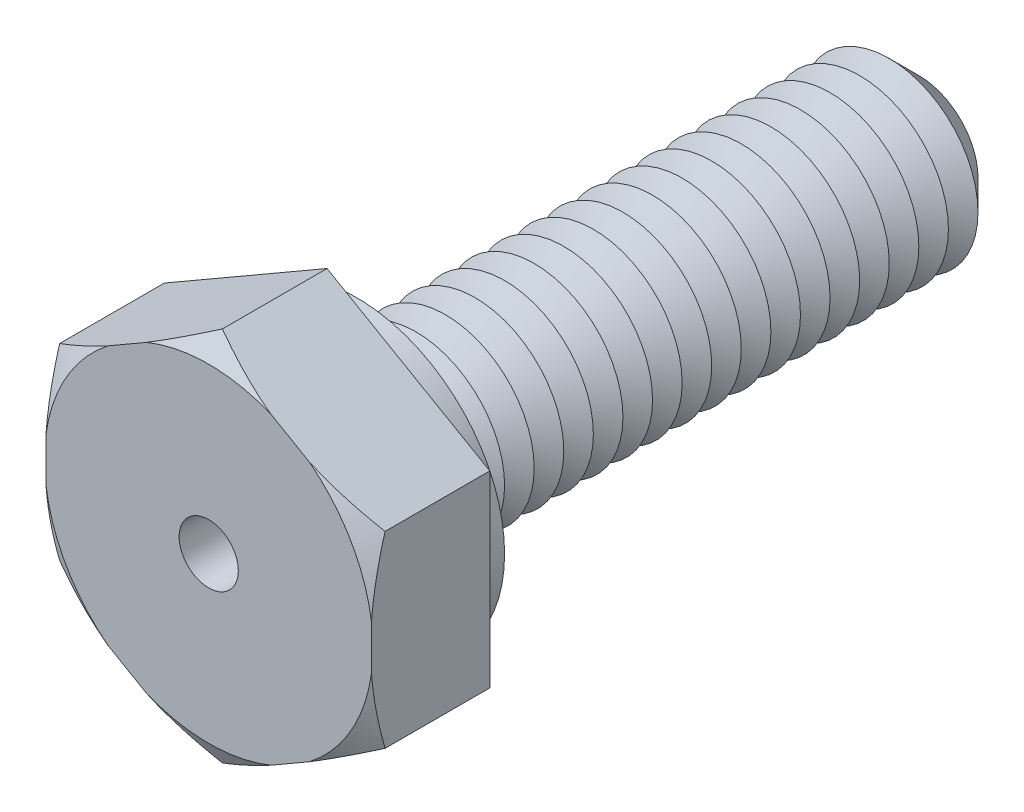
from build123d import *

# Parameters (mm, degrees)
BOSS_EXTRUDE1_DEPTH = 2
SKETCH3_R           = 1.5
BOSS_EXTRUDE2_DEPTH = 10
SKETCH4_R           = 2.5
BOSS_EXTRUDE3_DEPTH = 0.5
CHAMFER1_SIZE       = 0.5
LPATTERN1_COUNT     = 18
LPATTERN1_PITCH     = 0.5
SKETCH8_R           = 0.5
CUT_EXTRUDE1_DEPTH  = 12


with BuildPart() as part:
    # Sketch2 → Boss-Extrude1 (new body)
    with BuildSketch(Plane.XY):
        Polygon((0, 3.175426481), (-2.75, 1.58771324), (-2.75, -1.58771324), (0, -3.175426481), (2.75, -1.58771324), (2.75, 1.58771324), align=None)
    extrude(amount=BOSS_EXTRUDE1_DEPTH)

    # Sketch3 → Boss-Extrude2 (add)
    with BuildSketch(Plane(origin=(0, 0, 0), x_dir=(-1, 0, 0), z_dir=(0, 0, -1))):
        Circle(SKETCH3_R)
    extrude(amount=BOSS_EXTRUDE2_DEPTH)

    # Sketch4 → Boss-Extrude3 (add)
    with BuildSketch(Plane(origin=(0, 0, 0), x_dir=(-1, 0, 0), z_dir=(0, 0, -1))):
        with Locations(Location((0, 0, 0), (0, 0, 180))):
            Circle(SKETCH4_R)
    extrude(amount=BOSS_EXTRUDE3_DEPTH)

    # Chamfer1
    chamfer1_edges = [part.edges().sort_by_distance(p)[0] for p in [
        (1.5, 0, -10),
    ]]
    chamfer(chamfer1_edges, length=CHAMFER1_SIZE)

    # Sketch6 → Cut-Revolve1 (revolve, cut)
    with BuildSketch(Plane(origin=(0, 0, 0), x_dir=(0, 0, -1), z_dir=(1, 0, 0)), mode=Mode.PRIVATE) as cut_revolve1_sk:
        Polygon((0.5, 1.5), (0.75, 1.066987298), (1, 1.5), align=None)
    cut_revolve1 = revolve(cut_revolve1_sk.sketch.rotate(Axis((0, 0, 3.211670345), (0, 0, -1)), 90), axis=Axis((0, 0, 3.211670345), (0, 0, -1)), mode=Mode.SUBTRACT)

    # LPattern1: Cut-Revolve1 ×18
    with Locations(*[(0, 0, -i * LPATTERN1_PITCH) for i in range(1, LPATTERN1_COUNT)]):
        add(cut_revolve1, mode=Mode.SUBTRACT)

    # Sketch7 → Cut-Revolve2 (revolve, cut)
    with BuildSketch(Plane(origin=(0, 0, 0), x_dir=(0, 0, -1), z_dir=(1, 0, 0)), mode=Mode.PRIVATE) as cut_revolve2_sk:
        Polygon((-2, 3.175426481), (-2, 2.775426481), (-1.769059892, 3.175426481), align=None)
    revolve(cut_revolve2_sk.sketch.rotate(Axis((0, 0, 3.211670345), (0, 0, -1)), 90), axis=Axis((0, 0, 3.211670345), (0, 0, -1)), mode=Mode.SUBTRACT)

    # Sketch8 → Cut-Extrude1 (cut)
    with BuildSketch(Plane.XY.offset(2)):
        Circle(SKETCH8_R)
    extrude(amount=-CUT_EXTRUDE1_DEPTH, mode=Mode.SUBTRACT)


solid = part.part
